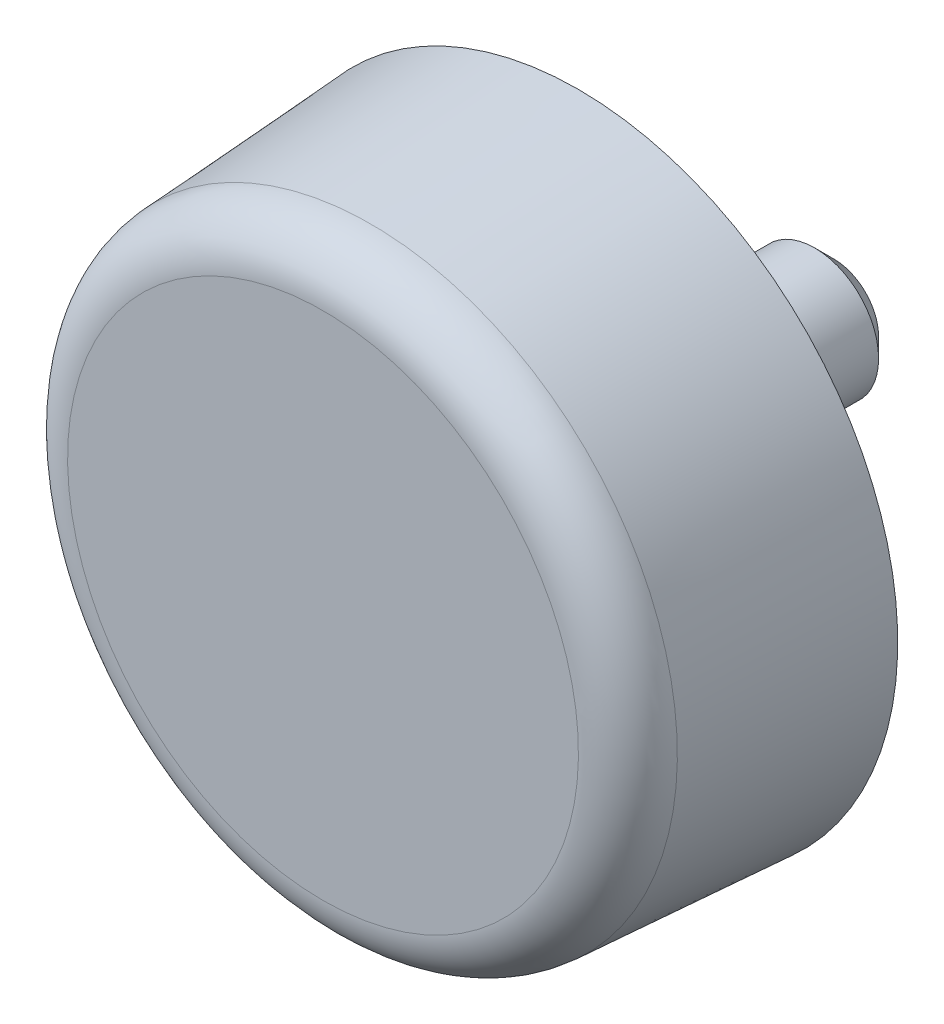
ISO-10303-21;
HEADER;
FILE_DESCRIPTION(('STEP AP214'),'2;1');
FILE_NAME('part.step','',(''),(''),'','','');
FILE_SCHEMA(('AUTOMOTIVE_DESIGN { 1 0 10303 214 1 1 1 1 }'));
ENDSEC;
DATA;
#1=APPLICATION_CONTEXT('core data for automotive mechanical design processes');
#2=APPLICATION_PROTOCOL_DEFINITION('international standard','automotive_design',2000,#1);
#3=PRODUCT_CONTEXT('',#1,'mechanical');
#4=PRODUCT('Part','Part','',(#3));
#5=PRODUCT_RELATED_PRODUCT_CATEGORY('part','',(#4));
#6=PRODUCT_DEFINITION_FORMATION('','',#4);
#7=PRODUCT_DEFINITION_CONTEXT('part definition',#1,'design');
#8=PRODUCT_DEFINITION('design','',#6,#7);
#9=PRODUCT_DEFINITION_SHAPE('','',#8);
#10=(LENGTH_UNIT() NAMED_UNIT(*) SI_UNIT(.MILLI.,.METRE.));
#11=(NAMED_UNIT(*) PLANE_ANGLE_UNIT() SI_UNIT($,.RADIAN.));
#12=(NAMED_UNIT(*) SI_UNIT($,.STERADIAN.) SOLID_ANGLE_UNIT());
#13=UNCERTAINTY_MEASURE_WITH_UNIT(LENGTH_MEASURE(1.E-05),#10,'distance_accuracy_value','');
#14=(GEOMETRIC_REPRESENTATION_CONTEXT(3) GLOBAL_UNCERTAINTY_ASSIGNED_CONTEXT((#13)) GLOBAL_UNIT_ASSIGNED_CONTEXT((#10,
#11,#12)) REPRESENTATION_CONTEXT('',''));
#15=CARTESIAN_POINT('',(0.,0.,0.));
#16=DIRECTION('',(0.,0.,1.));
#17=DIRECTION('',(1.,0.,0.));
#18=AXIS2_PLACEMENT_3D('',#15,#16,#17);
#19=CARTESIAN_POINT('',(0.,0.,20.));
#20=DIRECTION('',(0.,0.,1.));
#21=DIRECTION('',(0.,-1.,0.));
#22=AXIS2_PLACEMENT_3D('',#19,#20,#21);
#23=CYLINDRICAL_SURFACE('',#22,22.5);
#24=CARTESIAN_POINT('',(0.,0.,0.));
#25=DIRECTION('',(0.,0.,1.));
#26=DIRECTION('',(0.,-1.,0.));
#27=AXIS2_PLACEMENT_3D('',#24,#25,#26);
#28=CIRCLE('',#27,22.5);
#29=CARTESIAN_POINT('',(0.,-22.5,0.));
#30=VERTEX_POINT('',#29);
#31=EDGE_CURVE('E27',#30,#30,#28,.T.);
#32=ORIENTED_EDGE('',*,*,#31,.F.);
#33=EDGE_LOOP('',(#32));
#34=FACE_BOUND('',#33,.T.);
#35=CARTESIAN_POINT('',(0.,0.,0.0500000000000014));
#36=DIRECTION('',(0.,0.,1.));
#37=DIRECTION('',(0.,-1.,0.));
#38=AXIS2_PLACEMENT_3D('',#35,#36,#37);
#39=CIRCLE('',#38,22.5);
#40=CARTESIAN_POINT('',(0.,-22.5,0.0500000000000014));
#41=VERTEX_POINT('',#40);
#42=EDGE_CURVE('E44',#41,#41,#39,.T.);
#43=ORIENTED_EDGE('',*,*,#42,.T.);
#44=EDGE_LOOP('',(#43));
#45=FACE_BOUND('',#44,.T.);
#46=ADVANCED_FACE('F12',(#34,#45),#23,.F.);
#47=CARTESIAN_POINT('',(22.5,0.,0.));
#48=DIRECTION('',(0.,0.,1.));
#49=DIRECTION('',(0.,-1.,0.));
#50=AXIS2_PLACEMENT_3D('',#47,#48,#49);
#51=PLANE('',#50);
#52=CARTESIAN_POINT('',(0.,0.,0.));
#53=DIRECTION('',(0.,0.,1.));
#54=DIRECTION('',(0.,-1.,0.));
#55=AXIS2_PLACEMENT_3D('',#52,#53,#54);
#56=CIRCLE('',#55,25.);
#57=CARTESIAN_POINT('',(0.,-25.,0.));
#58=VERTEX_POINT('',#57);
#59=EDGE_CURVE('E32',#58,#58,#56,.T.);
#60=ORIENTED_EDGE('',*,*,#59,.F.);
#61=EDGE_LOOP('',(#60));
#62=FACE_BOUND('',#61,.T.);
#63=ORIENTED_EDGE('',*,*,#31,.T.);
#64=EDGE_LOOP('',(#63));
#65=FACE_BOUND('',#64,.T.);
#66=ADVANCED_FACE('F72',(#62,#65),#51,.F.);
#67=CARTESIAN_POINT('',(0.,0.,0.));
#68=DIRECTION('',(0.,0.,-1.));
#69=DIRECTION('',(0.,1.,0.));
#70=AXIS2_PLACEMENT_3D('',#67,#68,#69);
#71=CONICAL_SURFACE('',#70,25.,0.0619403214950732);
#72=CARTESIAN_POINT('',(0.,0.,16.2476028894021));
#73=DIRECTION('',(0.,0.,1.));
#74=DIRECTION('',(0.,-1.,0.));
#75=AXIS2_PLACEMENT_3D('',#72,#73,#74);
#76=CIRCLE('',#75,23.9923292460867);
#77=CARTESIAN_POINT('',(0.,-23.9923292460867,16.2476028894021));
#78=VERTEX_POINT('',#77);
#79=EDGE_CURVE('E35',#78,#78,#76,.T.);
#80=ORIENTED_EDGE('',*,*,#79,.F.);
#81=EDGE_LOOP('',(#80));
#82=FACE_BOUND('',#81,.T.);
#83=ORIENTED_EDGE('',*,*,#59,.T.);
#84=EDGE_LOOP('',(#83));
#85=FACE_BOUND('',#84,.T.);
#86=ADVANCED_FACE('F77',(#82,#85),#71,.T.);
#87=CARTESIAN_POINT('',(0.,0.,16.));
#88=DIRECTION('',(0.,0.,1.));
#89=DIRECTION('',(0.,-1.,0.));
#90=AXIS2_PLACEMENT_3D('',#87,#88,#89);
#91=TOROIDAL_SURFACE('',#90,20.,4.);
#92=ORIENTED_EDGE('',*,*,#79,.T.);
#93=EDGE_LOOP('',(#92));
#94=FACE_BOUND('',#93,.T.);
#95=CARTESIAN_POINT('',(0.,0.,20.));
#96=DIRECTION('',(0.,0.,1.));
#97=DIRECTION('',(0.,-1.,0.));
#98=AXIS2_PLACEMENT_3D('',#95,#96,#97);
#99=CIRCLE('',#98,20.);
#100=CARTESIAN_POINT('',(0.,-20.,20.));
#101=VERTEX_POINT('',#100);
#102=EDGE_CURVE('E38',#101,#101,#99,.T.);
#103=ORIENTED_EDGE('',*,*,#102,.F.);
#104=EDGE_LOOP('',(#103));
#105=FACE_BOUND('',#104,.T.);
#106=ADVANCED_FACE('F84',(#94,#105),#91,.T.);
#107=CARTESIAN_POINT('',(20.,0.,20.));
#108=DIRECTION('',(0.,0.,-1.));
#109=DIRECTION('',(0.,1.,0.));
#110=AXIS2_PLACEMENT_3D('',#107,#108,#109);
#111=PLANE('',#110);
#112=ORIENTED_EDGE('',*,*,#102,.T.);
#113=EDGE_LOOP('',(#112));
#114=FACE_BOUND('',#113,.T.);
#115=ADVANCED_FACE('F59',(#114),#111,.F.);
#116=CARTESIAN_POINT('',(0.,0.,0.));
#117=DIRECTION('',(0.,0.,1.));
#118=DIRECTION('',(0.,-1.,0.));
#119=AXIS2_PLACEMENT_3D('',#116,#117,#118);
#120=PLANE('',#119);
#121=CARTESIAN_POINT('',(0.,0.,0.));
#122=DIRECTION('',(0.,0.,1.));
#123=DIRECTION('',(0.,-1.,0.));
#124=AXIS2_PLACEMENT_3D('',#121,#122,#123);
#125=CIRCLE('',#124,22.45);
#126=CARTESIAN_POINT('',(0.,-22.45,0.));
#127=VERTEX_POINT('',#126);
#128=EDGE_CURVE('E41',#127,#127,#125,.T.);
#129=ORIENTED_EDGE('',*,*,#128,.F.);
#130=EDGE_LOOP('',(#129));
#131=FACE_BOUND('',#130,.T.);
#132=CARTESIAN_POINT('',(0.,0.,0.));
#133=DIRECTION('',(0.,0.,1.));
#134=DIRECTION('',(0.,-1.,0.));
#135=AXIS2_PLACEMENT_3D('',#132,#133,#134);
#136=CIRCLE('',#135,5.);
#137=CARTESIAN_POINT('',(0.,-5.,0.));
#138=VERTEX_POINT('',#137);
#139=EDGE_CURVE('E23',#138,#138,#136,.T.);
#140=ORIENTED_EDGE('',*,*,#139,.T.);
#141=EDGE_LOOP('',(#140));
#142=FACE_BOUND('',#141,.T.);
#143=ADVANCED_FACE('F53',(#131,#142),#120,.F.);
#144=CARTESIAN_POINT('',(0.,0.,0.));
#145=DIRECTION('',(0.,0.,1.));
#146=DIRECTION('',(0.,-1.,0.));
#147=AXIS2_PLACEMENT_3D('',#144,#145,#146);
#148=CONICAL_SURFACE('',#147,22.45,0.785398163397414);
#149=ORIENTED_EDGE('',*,*,#42,.F.);
#150=EDGE_LOOP('',(#149));
#151=FACE_BOUND('',#150,.T.);
#152=ORIENTED_EDGE('',*,*,#128,.T.);
#153=EDGE_LOOP('',(#152));
#154=FACE_BOUND('',#153,.T.);
#155=ADVANCED_FACE('F49',(#151,#154),#148,.T.);
#156=CARTESIAN_POINT('',(0.,0.,20.));
#157=DIRECTION('',(0.,0.,1.));
#158=DIRECTION('',(0.,-1.,0.));
#159=AXIS2_PLACEMENT_3D('',#156,#157,#158);
#160=CYLINDRICAL_SURFACE('',#159,5.);
#161=CARTESIAN_POINT('',(0.,0.,-18.5));
#162=DIRECTION('',(0.,0.,-1.));
#163=DIRECTION('',(0.,1.,0.));
#164=AXIS2_PLACEMENT_3D('',#161,#162,#163);
#165=CIRCLE('',#164,5.);
#166=CARTESIAN_POINT('',(0.,5.,-18.5));
#167=VERTEX_POINT('',#166);
#168=EDGE_CURVE('E8',#167,#167,#165,.F.);
#169=ORIENTED_EDGE('',*,*,#168,.T.);
#170=EDGE_LOOP('',(#169));
#171=FACE_BOUND('',#170,.T.);
#172=ORIENTED_EDGE('',*,*,#139,.F.);
#173=EDGE_LOOP('',(#172));
#174=FACE_BOUND('',#173,.T.);
#175=ADVANCED_FACE('F52',(#171,#174),#160,.T.);
#176=CARTESIAN_POINT('',(0.,0.,-20.));
#177=DIRECTION('',(0.,0.,-1.));
#178=DIRECTION('',(0.,1.,0.));
#179=AXIS2_PLACEMENT_3D('',#176,#177,#178);
#180=PLANE('',#179);
#181=CARTESIAN_POINT('',(0.,0.,-20.));
#182=DIRECTION('',(0.,0.,-1.));
#183=DIRECTION('',(0.,1.,0.));
#184=AXIS2_PLACEMENT_3D('',#181,#182,#183);
#185=CIRCLE('',#184,3.5);
#186=CARTESIAN_POINT('',(0.,3.5,-20.));
#187=VERTEX_POINT('',#186);
#188=EDGE_CURVE('E19',#187,#187,#185,.T.);
#189=ORIENTED_EDGE('',*,*,#188,.T.);
#190=EDGE_LOOP('',(#189));
#191=FACE_BOUND('',#190,.T.);
#192=ADVANCED_FACE('F64',(#191),#180,.T.);
#193=CARTESIAN_POINT('',(0.,0.,-20.));
#194=DIRECTION('',(0.,0.,1.));
#195=DIRECTION('',(0.,-1.,0.));
#196=AXIS2_PLACEMENT_3D('',#193,#194,#195);
#197=CONICAL_SURFACE('',#196,3.5,0.785398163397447);
#198=ORIENTED_EDGE('',*,*,#168,.F.);
#199=EDGE_LOOP('',(#198));
#200=FACE_BOUND('',#199,.T.);
#201=ORIENTED_EDGE('',*,*,#188,.F.);
#202=EDGE_LOOP('',(#201));
#203=FACE_BOUND('',#202,.T.);
#204=ADVANCED_FACE('F14',(#200,#203),#197,.T.);
#205=CLOSED_SHELL('',(#46,#66,#86,#106,#115,#143,#155,#175,#192,#204));
#206=MANIFOLD_SOLID_BREP('B1',#205);
#207=ADVANCED_BREP_SHAPE_REPRESENTATION('',(#18,#206),#14);
#208=SHAPE_DEFINITION_REPRESENTATION(#9,#207);
ENDSEC;
END-ISO-10303-21;
